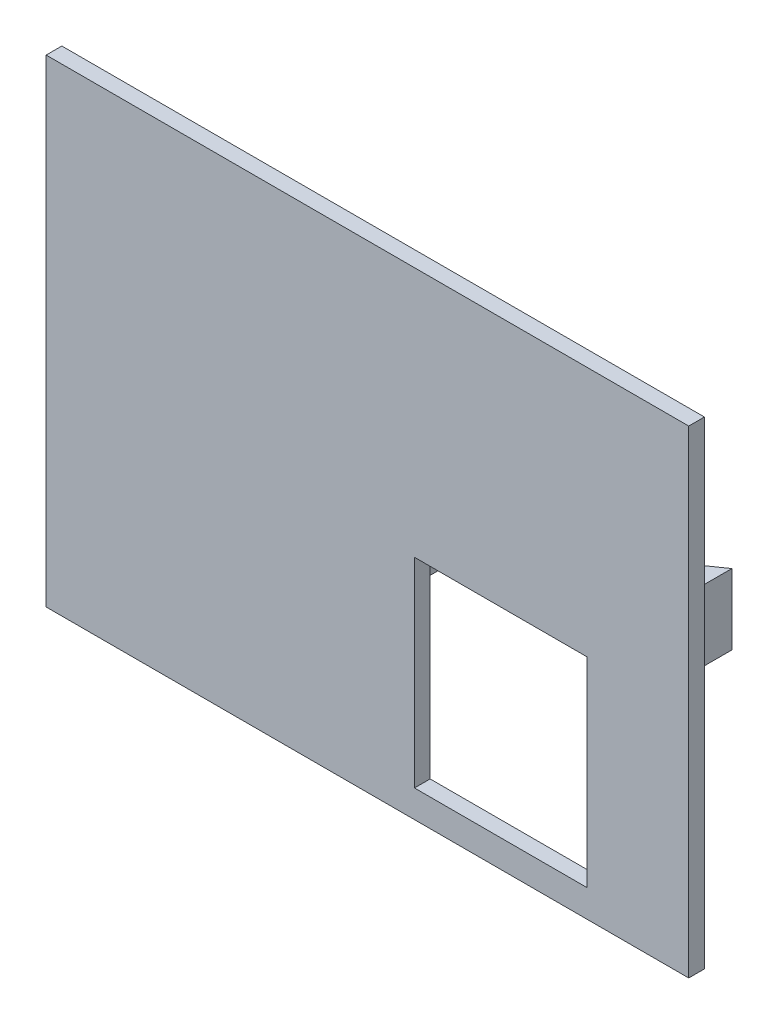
from build123d import *

# Parameters (mm, degrees)
CROQUIS1_W              = 82
CROQUIS1_H              = 61
SALIENTE_EXTRUIR1_DEPTH = 2
CROQUIS2_W              = 22
CROQUIS2_H              = 25.5
CORTAR_EXTRUIR1_DEPTH   = 2
CROQUIS8_W              = 1.5
CROQUIS8_H              = 9
SALIENTE_EXTRUIR2_DEPTH = 9
CROQUIS9_W              = 4.3
CROQUIS9_H              = 9
SALIENTE_EXTRUIR3_DEPTH = 3
CORTAR_EXTRUIR2_DEPTH   = 9


with BuildPart() as part:
    # Croquis1 → Saliente-Extruir1 (new body)
    with BuildSketch(Plane.XY):
        with Locations((-6.383707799, 7.967462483)):
            Rectangle(CROQUIS1_W, CROQUIS1_H)
    extrude(amount=SALIENTE_EXTRUIR1_DEPTH)

    # Croquis2 → Cortar-Extruir1 (cut)
    with BuildSketch(Plane(origin=(0, 0, 0), x_dir=(-1, 0, 0), z_dir=(0, 0, -1))):
        with Locations((-10.616292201, -6.282537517)):
            Rectangle(CROQUIS2_W, CROQUIS2_H)
    extrude(amount=-CORTAR_EXTRUIR1_DEPTH, mode=Mode.SUBTRACT)

    # Croquis8 → Saliente-Extruir2 (add)
    with BuildSketch(Plane(origin=(0, 0, 0), x_dir=(-1, 0, 0), z_dir=(0, 0, -1))):
        with Locations((-25.366292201, 6.967462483)):
            Rectangle(CROQUIS8_W, CROQUIS8_H)
        with Locations((2.133707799, 6.967462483)):
            Rectangle(CROQUIS8_W, CROQUIS8_H)
    extrude(amount=SALIENTE_EXTRUIR2_DEPTH)

    # Croquis9 → Saliente-Extruir3 (add)
    with BuildSketch(Plane(origin=(0, 0, -9), x_dir=(-1, 0, 0), z_dir=(0, 0, -1))):
        with Locations((-23.966292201, 6.967462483)):
            Rectangle(CROQUIS9_W, CROQUIS9_H)
        with Locations((0.733707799, 6.967462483)):
            Rectangle(CROQUIS9_W, CROQUIS9_H)
    extrude(amount=SALIENTE_EXTRUIR3_DEPTH)

    # Croquis10 → Cortar-Extruir2 (cut)
    with BuildSketch(Plane.XZ.offset(-2.467462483)):
        Polygon((26.116292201, -12), (21.816292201, -9), (21.816292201, -12), align=None)
        Polygon((1.416292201, -9), (-2.883707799, -12), (1.416292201, -12), align=None)
    extrude(amount=-CORTAR_EXTRUIR2_DEPTH, mode=Mode.SUBTRACT)


solid = part.part
